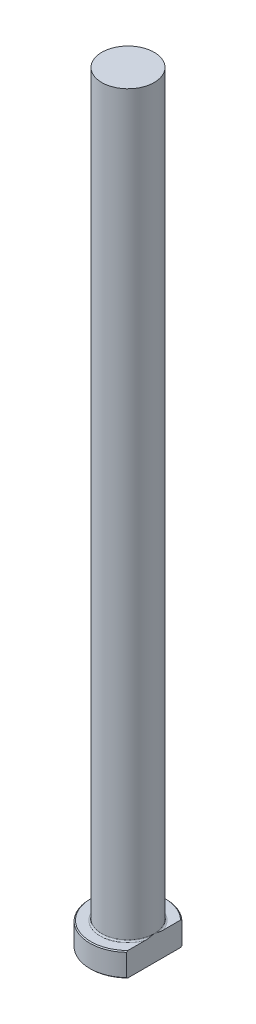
ISO-10303-21;
HEADER;
FILE_DESCRIPTION(('STEP AP214'),'2;1');
FILE_NAME('part.step','',(''),(''),'','','');
FILE_SCHEMA(('AUTOMOTIVE_DESIGN { 1 0 10303 214 1 1 1 1 }'));
ENDSEC;
DATA;
#1=APPLICATION_CONTEXT('core data for automotive mechanical design processes');
#2=APPLICATION_PROTOCOL_DEFINITION('international standard','automotive_design',2000,#1);
#3=PRODUCT_CONTEXT('',#1,'mechanical');
#4=PRODUCT('Part','Part','',(#3));
#5=PRODUCT_RELATED_PRODUCT_CATEGORY('part','',(#4));
#6=PRODUCT_DEFINITION_FORMATION('','',#4);
#7=PRODUCT_DEFINITION_CONTEXT('part definition',#1,'design');
#8=PRODUCT_DEFINITION('design','',#6,#7);
#9=PRODUCT_DEFINITION_SHAPE('','',#8);
#10=(LENGTH_UNIT() NAMED_UNIT(*) SI_UNIT(.MILLI.,.METRE.));
#11=(NAMED_UNIT(*) PLANE_ANGLE_UNIT() SI_UNIT($,.RADIAN.));
#12=(NAMED_UNIT(*) SI_UNIT($,.STERADIAN.) SOLID_ANGLE_UNIT());
#13=UNCERTAINTY_MEASURE_WITH_UNIT(LENGTH_MEASURE(1.E-05),#10,'distance_accuracy_value','');
#14=(GEOMETRIC_REPRESENTATION_CONTEXT(3) GLOBAL_UNCERTAINTY_ASSIGNED_CONTEXT((#13)) GLOBAL_UNIT_ASSIGNED_CONTEXT((#10,
#11,#12)) REPRESENTATION_CONTEXT('',''));
#15=CARTESIAN_POINT('',(0.,0.,0.));
#16=DIRECTION('',(0.,0.,1.));
#17=DIRECTION('',(1.,0.,0.));
#18=AXIS2_PLACEMENT_3D('',#15,#16,#17);
#19=CARTESIAN_POINT('',(0.,0.,0.));
#20=DIRECTION('',(0.,-1.,0.));
#21=DIRECTION('',(0.,0.,-1.));
#22=AXIS2_PLACEMENT_3D('',#19,#20,#21);
#23=PLANE('',#22);
#24=CARTESIAN_POINT('',(0.,0.,0.));
#25=DIRECTION('',(0.,-1.,0.));
#26=DIRECTION('',(0.,0.,-1.));
#27=AXIS2_PLACEMENT_3D('',#24,#25,#26);
#28=CIRCLE('',#27,7.79999999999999);
#29=CARTESIAN_POINT('',(5.49999999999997,0.,5.53082272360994));
#30=VERTEX_POINT('',#29);
#31=CARTESIAN_POINT('',(5.49999999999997,0.,-5.53082272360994));
#32=VERTEX_POINT('',#31);
#33=EDGE_CURVE('E98',#30,#32,#28,.T.);
#34=ORIENTED_EDGE('',*,*,#33,.T.);
#35=DIRECTION('',(0.,0.,1.));
#36=VECTOR('',#35,1.);
#37=CARTESIAN_POINT('',(5.49999999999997,0.,-5.80947501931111));
#38=LINE('',#37,#36);
#39=EDGE_CURVE('E83',#32,#30,#38,.T.);
#40=ORIENTED_EDGE('',*,*,#39,.T.);
#41=EDGE_LOOP('',(#34,#40));
#42=FACE_BOUND('',#41,.T.);
#43=ADVANCED_FACE('F32',(#42),#23,.T.);
#44=CARTESIAN_POINT('',(0.,259.958771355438,0.));
#45=DIRECTION('',(0.,1.,0.));
#46=DIRECTION('',(0.,0.,1.));
#47=AXIS2_PLACEMENT_3D('',#44,#45,#46);
#48=CYLINDRICAL_SURFACE('',#47,7.99999999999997);
#49=CARTESIAN_POINT('',(0.,4.79999999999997,0.));
#50=DIRECTION('',(0.,1.,0.));
#51=DIRECTION('',(0.,0.,1.));
#52=AXIS2_PLACEMENT_3D('',#49,#50,#51);
#53=CIRCLE('',#52,7.99999999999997);
#54=CARTESIAN_POINT('',(5.49999999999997,4.79999999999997,5.80947501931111));
#55=VERTEX_POINT('',#54);
#56=CARTESIAN_POINT('',(5.49999999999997,4.79999999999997,-5.80947501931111));
#57=VERTEX_POINT('',#56);
#58=EDGE_CURVE('E104',#55,#57,#53,.F.);
#59=ORIENTED_EDGE('',*,*,#58,.T.);
#60=DIRECTION('',(0.,-1.,0.));
#61=VECTOR('',#60,1.);
#62=CARTESIAN_POINT('',(5.49999999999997,160.,-5.80947501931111));
#63=LINE('',#62,#61);
#64=CARTESIAN_POINT('',(5.49999999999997,0.199999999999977,-5.80947501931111));
#65=VERTEX_POINT('',#64);
#66=EDGE_CURVE('E183',#57,#65,#63,.T.);
#67=ORIENTED_EDGE('',*,*,#66,.T.);
#68=CARTESIAN_POINT('',(0.,0.199999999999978,0.));
#69=DIRECTION('',(0.,-1.,0.));
#70=DIRECTION('',(0.,0.,-1.));
#71=AXIS2_PLACEMENT_3D('',#68,#69,#70);
#72=CIRCLE('',#71,7.99999999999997);
#73=CARTESIAN_POINT('',(5.49999999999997,0.199999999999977,5.80947501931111));
#74=VERTEX_POINT('',#73);
#75=EDGE_CURVE('E100',#65,#74,#72,.F.);
#76=ORIENTED_EDGE('',*,*,#75,.T.);
#77=DIRECTION('',(0.,-1.,0.));
#78=VECTOR('',#77,1.);
#79=CARTESIAN_POINT('',(5.49999999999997,160.,5.80947501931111));
#80=LINE('',#79,#78);
#81=EDGE_CURVE('E93',#55,#74,#80,.T.);
#82=ORIENTED_EDGE('',*,*,#81,.F.);
#83=EDGE_LOOP('',(#59,#67,#76,#82));
#84=FACE_BOUND('',#83,.T.);
#85=ADVANCED_FACE('F158',(#84),#48,.T.);
#86=CARTESIAN_POINT('',(-7.99999999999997,5.,0.));
#87=DIRECTION('',(0.,1.,0.));
#88=DIRECTION('',(0.,0.,1.));
#89=AXIS2_PLACEMENT_3D('',#86,#87,#88);
#90=PLANE('',#89);
#91=CARTESIAN_POINT('',(0.,5.,0.));
#92=DIRECTION('',(0.,1.,0.));
#93=DIRECTION('',(0.,0.,1.));
#94=AXIS2_PLACEMENT_3D('',#91,#92,#93);
#95=CIRCLE('',#94,7.79999999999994);
#96=CARTESIAN_POINT('',(5.49999999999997,5.,-5.53082272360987));
#97=VERTEX_POINT('',#96);
#98=CARTESIAN_POINT('',(5.49999999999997,5.,5.53082272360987));
#99=VERTEX_POINT('',#98);
#100=EDGE_CURVE('E178',#97,#99,#95,.T.);
#101=ORIENTED_EDGE('',*,*,#100,.T.);
#102=DIRECTION('',(0.,0.,-1.));
#103=VECTOR('',#102,1.);
#104=CARTESIAN_POINT('',(5.49999999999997,5.,0.));
#105=LINE('',#104,#103);
#106=CARTESIAN_POINT('',(5.49999999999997,4.99999999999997,1.84119526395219));
#107=VERTEX_POINT('',#106);
#108=EDGE_CURVE('E57',#99,#107,#105,.T.);
#109=ORIENTED_EDGE('',*,*,#108,.T.);
#110=CARTESIAN_POINT('',(0.,5.,0.));
#111=DIRECTION('',(0.,1.,0.));
#112=DIRECTION('',(0.,0.,1.));
#113=AXIS2_PLACEMENT_3D('',#110,#111,#112);
#114=CIRCLE('',#113,5.79999999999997);
#115=CARTESIAN_POINT('',(5.49999999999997,4.99999999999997,-1.84119526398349));
#116=VERTEX_POINT('',#115);
#117=EDGE_CURVE('E107',#107,#116,#114,.F.);
#118=ORIENTED_EDGE('',*,*,#117,.T.);
#119=EDGE_CURVE('E136',#116,#97,#105,.T.);
#120=ORIENTED_EDGE('',*,*,#119,.T.);
#121=EDGE_LOOP('',(#101,#109,#118,#120));
#122=FACE_BOUND('',#121,.T.);
#123=ADVANCED_FACE('F147',(#122),#90,.T.);
#124=CARTESIAN_POINT('',(0.,5.,0.));
#125=DIRECTION('',(0.,-1.,0.));
#126=DIRECTION('',(0.,0.,-1.));
#127=AXIS2_PLACEMENT_3D('',#124,#125,#126);
#128=CONICAL_SURFACE('',#127,7.79999999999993,0.785398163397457);
#129=ORIENTED_EDGE('',*,*,#58,.F.);
#130=CARTESIAN_POINT('',(5.49999999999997,-1.11515403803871,12.7820777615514));
#131=CARTESIAN_POINT('',(5.49999999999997,-0.941517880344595,12.5930460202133));
#132=CARTESIAN_POINT('',(5.49999999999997,-0.768204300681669,12.4037180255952));
#133=CARTESIAN_POINT('',(5.49999999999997,-0.422318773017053,12.0243831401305));
#134=CARTESIAN_POINT('',(5.49999999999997,-0.249746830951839,11.8343762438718));
#135=CARTESIAN_POINT('',(5.49999999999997,0.266785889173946,11.2631256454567));
#136=CARTESIAN_POINT('',(5.49999999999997,0.609484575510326,10.880737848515));
#137=CARTESIAN_POINT('',(5.49999999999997,1.292565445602,10.1095655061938));
#138=CARTESIAN_POINT('',(5.49999999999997,1.63291928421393,9.72075580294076));
#139=CARTESIAN_POINT('',(5.49999999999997,2.30738282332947,8.93782165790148));
#140=CARTESIAN_POINT('',(5.49999999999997,2.64149328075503,8.54369787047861));
#141=CARTESIAN_POINT('',(5.49999999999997,3.2425140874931,7.81851180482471));
#142=CARTESIAN_POINT('',(5.49999999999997,3.51085021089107,7.48863708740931));
#143=CARTESIAN_POINT('',(5.49999999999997,3.90712731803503,6.98880713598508));
#144=CARTESIAN_POINT('',(5.49999999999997,4.03820076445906,6.82133570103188));
#145=CARTESIAN_POINT('',(5.49999999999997,4.29784042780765,6.48446279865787));
#146=CARTESIAN_POINT('',(5.49999999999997,4.42640670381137,6.3150613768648));
#147=CARTESIAN_POINT('',(5.49999999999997,4.68038690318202,5.97419641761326));
#148=CARTESIAN_POINT('',(5.49999999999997,4.80580413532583,5.80273535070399));
#149=CARTESIAN_POINT('',(5.49999999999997,5.05297330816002,5.45719748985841));
#150=CARTESIAN_POINT('',(5.49999999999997,5.17472543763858,5.28312083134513));
#151=CARTESIAN_POINT('',(5.49999999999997,5.41367984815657,4.93196486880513));
#152=CARTESIAN_POINT('',(5.49999999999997,5.5308839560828,4.75488681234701));
#153=CARTESIAN_POINT('',(5.49999999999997,5.75968250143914,4.3971560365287));
#154=CARTESIAN_POINT('',(5.49999999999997,5.87127761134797,4.21650374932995));
#155=CARTESIAN_POINT('',(5.49999999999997,6.08629942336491,3.85292662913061));
#156=CARTESIAN_POINT('',(5.49999999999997,6.18979942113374,3.67004539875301));
#157=CARTESIAN_POINT('',(5.49999999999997,6.38808999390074,3.2995574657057));
#158=CARTESIAN_POINT('',(5.49999999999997,6.48287965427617,3.11195026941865));
#159=CARTESIAN_POINT('',(5.49999999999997,6.66127167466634,2.73169295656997));
#160=CARTESIAN_POINT('',(5.49999999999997,6.74488626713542,2.53904863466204));
#161=CARTESIAN_POINT('',(5.49999999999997,6.89808375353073,2.14822839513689));
#162=CARTESIAN_POINT('',(5.49999999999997,6.96767069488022,1.9500540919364));
#163=CARTESIAN_POINT('',(5.49999999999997,7.07670147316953,1.59030424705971));
#164=CARTESIAN_POINT('',(5.49999999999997,7.11940527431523,1.42972239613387));
#165=CARTESIAN_POINT('',(5.49999999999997,7.19217730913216,1.10570020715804));
#166=CARTESIAN_POINT('',(5.49999999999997,7.22224726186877,0.942260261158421));
#167=CARTESIAN_POINT('',(5.49999999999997,7.26823317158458,0.613832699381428));
#168=CARTESIAN_POINT('',(5.49999999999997,7.28418798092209,0.448850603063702));
#169=CARTESIAN_POINT('',(5.49999999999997,7.30121051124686,0.118111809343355));
#170=CARTESIAN_POINT('',(5.49999999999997,7.30227865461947,-0.0476448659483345));
#171=CARTESIAN_POINT('',(5.49999999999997,7.28946437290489,-0.378643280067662));
#172=CARTESIAN_POINT('',(5.49999999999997,7.27557532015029,-0.543884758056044));
#173=CARTESIAN_POINT('',(5.49999999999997,7.23360586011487,-0.872541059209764));
#174=CARTESIAN_POINT('',(5.49999999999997,7.20552424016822,-1.03595572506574));
#175=CARTESIAN_POINT('',(5.49999999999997,7.13645491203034,-1.36050703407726));
#176=CARTESIAN_POINT('',(5.49999999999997,7.09542895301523,-1.52163542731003));
#177=CARTESIAN_POINT('',(5.49999999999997,7.0022009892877,-1.84058362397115));
#178=CARTESIAN_POINT('',(5.49999999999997,6.949998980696,-1.99840342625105));
#179=CARTESIAN_POINT('',(5.49999999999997,6.82412729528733,-2.34351289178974));
#180=CARTESIAN_POINT('',(5.49999999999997,6.7482520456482,-2.52999311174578));
#181=CARTESIAN_POINT('',(5.49999999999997,6.58537605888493,-2.89807095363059));
#182=CARTESIAN_POINT('',(5.49999999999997,6.49837001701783,-3.07966619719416));
#183=CARTESIAN_POINT('',(5.49999999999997,6.31536700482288,-3.43865575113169));
#184=CARTESIAN_POINT('',(5.49999999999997,6.21935375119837,-3.61604169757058));
#185=CARTESIAN_POINT('',(5.49999999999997,6.02029718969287,-3.96676299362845));
#186=CARTESIAN_POINT('',(5.49999999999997,5.91725492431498,-4.14009893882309));
#187=CARTESIAN_POINT('',(5.49999999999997,5.70428964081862,-4.48528329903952));
#188=CARTESIAN_POINT('',(5.49999999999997,5.59430018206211,-4.65709053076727));
#189=CARTESIAN_POINT('',(5.49999999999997,5.36966321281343,-4.99762683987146));
#190=CARTESIAN_POINT('',(5.49999999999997,5.25501557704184,-5.16635583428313));
#191=CARTESIAN_POINT('',(5.49999999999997,5.02205528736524,-5.50098485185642));
#192=CARTESIAN_POINT('',(5.49999999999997,4.90374674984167,-5.66688774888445));
#193=CARTESIAN_POINT('',(5.49999999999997,4.66400808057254,-5.99642589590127));
#194=CARTESIAN_POINT('',(5.49999999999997,4.54257783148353,-6.16006106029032));
#195=CARTESIAN_POINT('',(5.49999999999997,4.20154795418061,-6.61207712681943));
#196=CARTESIAN_POINT('',(5.49999999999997,3.97915323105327,-6.89834873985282));
#197=CARTESIAN_POINT('',(5.49999999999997,3.52835863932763,-7.4661257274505));
#198=CARTESIAN_POINT('',(5.49999999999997,3.29995838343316,-7.74763079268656));
#199=CARTESIAN_POINT('',(5.49999999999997,2.83846100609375,-8.30706072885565));
#200=CARTESIAN_POINT('',(5.49999999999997,2.60536095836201,-8.58498318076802));
#201=CARTESIAN_POINT('',(5.49999999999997,2.13563301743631,-9.13783071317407));
#202=CARTESIAN_POINT('',(5.49999999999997,1.89900507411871,-9.41275575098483));
#203=CARTESIAN_POINT('',(5.49999999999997,1.43345389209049,-9.94811769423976));
#204=CARTESIAN_POINT('',(5.49999999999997,1.20465068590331,-10.2086591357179));
#205=CARTESIAN_POINT('',(5.49999999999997,0.744976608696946,-10.7279148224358));
#206=CARTESIAN_POINT('',(5.49999999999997,0.514105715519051,-10.9866290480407));
#207=CARTESIAN_POINT('',(5.49999999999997,0.0509694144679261,-11.502200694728));
#208=CARTESIAN_POINT('',(5.49999999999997,-0.181293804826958,-11.7590600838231));
#209=CARTESIAN_POINT('',(5.49999999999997,-0.647231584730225,-12.2714820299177));
#210=CARTESIAN_POINT('',(5.49999999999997,-0.880906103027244,-12.5270446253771));
#211=CARTESIAN_POINT('',(5.49999999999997,-1.11515403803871,-12.7820777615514));
#212=B_SPLINE_CURVE_WITH_KNOTS('',3,(#130,#131,#132,#133,#134,#135,#136,#137,#138,#139,#140,
#141,#142,#143,#144,#145,#146,#147,#148,#149,#150,#151,#152,#153,#154,#155,#156,#157,#158,#159,
#160,#161,#162,#163,#164,#165,#166,#167,#168,#169,#170,#171,#172,#173,#174,#175,#176,#177,#178,
#179,#180,#181,#182,#183,#184,#185,#186,#187,#188,#189,#190,#191,#192,#193,#194,#195,#196,#197,
#198,#199,#200,#201,#202,#203,#204,#205,#206,#207,#208,#209,#210,#211),.UNSPECIFIED.,.F.,.F.,(4,
2,2,2,2,2,2,2,2,2,2,2,2,2,2,2,2,2,2,2,2,2,2,2,2,2,2,2,2,2,2,2,2,2,2,2,2,2,2,2,4),(0.,
0.770026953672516,1.54006005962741,3.08047615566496,4.63063153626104,6.18059774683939,
7.45618053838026,8.09416066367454,8.73212573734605,9.36938977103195,10.0066209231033,
10.6435933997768,11.2804893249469,11.9107163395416,12.5410094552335,13.1706068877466,
13.8000224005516,14.2980757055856,14.7960612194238,15.2926717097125,15.7892681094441,
16.2860846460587,16.7829436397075,17.281284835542,17.7796262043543,18.383134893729,
18.9869322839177,19.5918430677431,20.1966643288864,20.8085675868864,21.4204873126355,
22.0317423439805,22.6430203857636,23.730416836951,24.8178835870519,25.9060497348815,
26.9942313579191,28.0344561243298,29.0746920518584,30.11358322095,31.1524433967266),.UNSPECIFIED.);
#213=EDGE_CURVE('E135',#55,#99,#212,.T.);
#214=ORIENTED_EDGE('',*,*,#213,.T.);
#215=ORIENTED_EDGE('',*,*,#100,.F.);
#216=EDGE_CURVE('E127',#97,#57,#212,.T.);
#217=ORIENTED_EDGE('',*,*,#216,.T.);
#218=EDGE_LOOP('',(#129,#214,#215,#217));
#219=FACE_BOUND('',#218,.T.);
#220=ADVANCED_FACE('F143',(#219),#128,.T.);
#221=CARTESIAN_POINT('',(0.,0.199999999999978,0.));
#222=DIRECTION('',(0.,1.,0.));
#223=DIRECTION('',(0.,0.,1.));
#224=AXIS2_PLACEMENT_3D('',#221,#222,#223);
#225=CONICAL_SURFACE('',#224,7.99999999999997,0.785398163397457);
#226=ORIENTED_EDGE('',*,*,#75,.F.);
#227=CARTESIAN_POINT('',(5.49999999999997,6.11515403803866,-12.7820777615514));
#228=CARTESIAN_POINT('',(5.49999999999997,5.94151788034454,-12.5930460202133));
#229=CARTESIAN_POINT('',(5.49999999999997,5.76820430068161,-12.4037180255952));
#230=CARTESIAN_POINT('',(5.49999999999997,5.422318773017,-12.0243831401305));
#231=CARTESIAN_POINT('',(5.49999999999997,5.24974683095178,-11.8343762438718));
#232=CARTESIAN_POINT('',(5.49999999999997,4.733214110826,-11.2631256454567));
#233=CARTESIAN_POINT('',(5.49999999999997,4.39051542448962,-10.880737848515));
#234=CARTESIAN_POINT('',(5.49999999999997,3.70743455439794,-10.1095655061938));
#235=CARTESIAN_POINT('',(5.49999999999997,3.36708071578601,-9.72075580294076));
#236=CARTESIAN_POINT('',(5.49999999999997,2.69261717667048,-8.93782165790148));
#237=CARTESIAN_POINT('',(5.49999999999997,2.35850671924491,-8.5436978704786));
#238=CARTESIAN_POINT('',(5.49999999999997,1.75748591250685,-7.81851180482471));
#239=CARTESIAN_POINT('',(5.49999999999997,1.48914978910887,-7.4886370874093));
#240=CARTESIAN_POINT('',(5.49999999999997,1.09287268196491,-6.98880713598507));
#241=CARTESIAN_POINT('',(5.49999999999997,0.96179923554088,-6.82133570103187));
#242=CARTESIAN_POINT('',(5.49999999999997,0.702159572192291,-6.48446279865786));
#243=CARTESIAN_POINT('',(5.49999999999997,0.573593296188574,-6.31506137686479));
#244=CARTESIAN_POINT('',(5.49999999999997,0.319613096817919,-5.97419641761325));
#245=CARTESIAN_POINT('',(5.49999999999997,0.194195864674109,-5.80273535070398));
#246=CARTESIAN_POINT('',(5.49999999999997,-0.0529733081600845,-5.4571974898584));
#247=CARTESIAN_POINT('',(5.49999999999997,-0.174725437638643,-5.28312083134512));
#248=CARTESIAN_POINT('',(5.49999999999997,-0.413679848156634,-4.93196486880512));
#249=CARTESIAN_POINT('',(5.49999999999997,-0.530883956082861,-4.75488681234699));
#250=CARTESIAN_POINT('',(5.49999999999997,-0.759682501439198,-4.39715603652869));
#251=CARTESIAN_POINT('',(5.49999999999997,-0.871277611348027,-4.21650374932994));
#252=CARTESIAN_POINT('',(5.49999999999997,-1.08629942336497,-3.8529266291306));
#253=CARTESIAN_POINT('',(5.49999999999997,-1.1897994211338,-3.67004539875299));
#254=CARTESIAN_POINT('',(5.49999999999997,-1.3880899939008,-3.29955746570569));
#255=CARTESIAN_POINT('',(5.49999999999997,-1.48287965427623,-3.11195026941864));
#256=CARTESIAN_POINT('',(5.49999999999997,-1.66127167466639,-2.73169295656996));
#257=CARTESIAN_POINT('',(5.49999999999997,-1.74488626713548,-2.53904863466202));
#258=CARTESIAN_POINT('',(5.49999999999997,-1.89808375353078,-2.14822839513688));
#259=CARTESIAN_POINT('',(5.49999999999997,-1.96767069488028,-1.95005409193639));
#260=CARTESIAN_POINT('',(5.49999999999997,-2.07670147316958,-1.5903042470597));
#261=CARTESIAN_POINT('',(5.49999999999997,-2.11940527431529,-1.42972239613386));
#262=CARTESIAN_POINT('',(5.49999999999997,-2.19217730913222,-1.10570020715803));
#263=CARTESIAN_POINT('',(5.49999999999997,-2.22224726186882,-0.942260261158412));
#264=CARTESIAN_POINT('',(5.49999999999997,-2.26823317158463,-0.613832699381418));
#265=CARTESIAN_POINT('',(5.49999999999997,-2.28418798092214,-0.448850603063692));
#266=CARTESIAN_POINT('',(5.49999999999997,-2.30121051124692,-0.118111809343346));
#267=CARTESIAN_POINT('',(5.49999999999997,-2.30227865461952,0.0476448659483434));
#268=CARTESIAN_POINT('',(5.49999999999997,-2.28946437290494,0.378643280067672));
#269=CARTESIAN_POINT('',(5.49999999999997,-2.27557532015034,0.543884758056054));
#270=CARTESIAN_POINT('',(5.49999999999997,-2.23360586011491,0.872541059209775));
#271=CARTESIAN_POINT('',(5.49999999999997,-2.20552424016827,1.03595572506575));
#272=CARTESIAN_POINT('',(5.49999999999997,-2.13645491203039,1.36050703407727));
#273=CARTESIAN_POINT('',(5.49999999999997,-2.09542895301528,1.52163542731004));
#274=CARTESIAN_POINT('',(5.49999999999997,-2.00220098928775,1.84058362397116));
#275=CARTESIAN_POINT('',(5.49999999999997,-1.94999898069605,1.99840342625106));
#276=CARTESIAN_POINT('',(5.49999999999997,-1.82412729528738,2.34351289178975));
#277=CARTESIAN_POINT('',(5.49999999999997,-1.74825204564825,2.52999311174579));
#278=CARTESIAN_POINT('',(5.49999999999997,-1.58537605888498,2.8980709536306));
#279=CARTESIAN_POINT('',(5.49999999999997,-1.49837001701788,3.07966619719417));
#280=CARTESIAN_POINT('',(5.49999999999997,-1.31536700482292,3.4386557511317));
#281=CARTESIAN_POINT('',(5.49999999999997,-1.21935375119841,3.6160416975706));
#282=CARTESIAN_POINT('',(5.49999999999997,-1.02029718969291,3.96676299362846));
#283=CARTESIAN_POINT('',(5.49999999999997,-0.917254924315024,4.1400989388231));
#284=CARTESIAN_POINT('',(5.49999999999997,-0.704289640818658,4.48528329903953));
#285=CARTESIAN_POINT('',(5.49999999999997,-0.594300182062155,4.65709053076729));
#286=CARTESIAN_POINT('',(5.49999999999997,-0.369663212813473,4.99762683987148));
#287=CARTESIAN_POINT('',(5.49999999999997,-0.255015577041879,5.16635583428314));
#288=CARTESIAN_POINT('',(5.49999999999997,-0.0220552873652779,5.50098485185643));
#289=CARTESIAN_POINT('',(5.49999999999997,0.0962532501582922,5.66688774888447));
#290=CARTESIAN_POINT('',(5.49999999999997,0.335991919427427,5.99642589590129));
#291=CARTESIAN_POINT('',(5.49999999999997,0.457422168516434,6.16006106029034));
#292=CARTESIAN_POINT('',(5.49999999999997,0.798452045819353,6.61207712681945));
#293=CARTESIAN_POINT('',(5.49999999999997,1.02084676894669,6.89834873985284));
#294=CARTESIAN_POINT('',(5.49999999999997,1.47164136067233,7.46612572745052));
#295=CARTESIAN_POINT('',(5.49999999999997,1.7000416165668,7.74763079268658));
#296=CARTESIAN_POINT('',(5.49999999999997,2.16153899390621,8.30706072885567));
#297=CARTESIAN_POINT('',(5.49999999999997,2.39463904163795,8.58498318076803));
#298=CARTESIAN_POINT('',(5.49999999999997,2.86436698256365,9.13783071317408));
#299=CARTESIAN_POINT('',(5.49999999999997,3.10099492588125,9.41275575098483));
#300=CARTESIAN_POINT('',(5.49999999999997,3.56654610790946,9.94811769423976));
#301=CARTESIAN_POINT('',(5.49999999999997,3.79534931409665,10.2086591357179));
#302=CARTESIAN_POINT('',(5.49999999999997,4.25502339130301,10.7279148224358));
#303=CARTESIAN_POINT('',(5.49999999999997,4.4858942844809,10.9866290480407));
#304=CARTESIAN_POINT('',(5.49999999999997,4.94903058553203,11.502200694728));
#305=CARTESIAN_POINT('',(5.49999999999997,5.18129380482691,11.7590600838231));
#306=CARTESIAN_POINT('',(5.49999999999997,5.64723158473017,12.2714820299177));
#307=CARTESIAN_POINT('',(5.49999999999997,5.88090610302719,12.5270446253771));
#308=CARTESIAN_POINT('',(5.49999999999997,6.11515403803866,12.7820777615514));
#309=B_SPLINE_CURVE_WITH_KNOTS('',3,(#227,#228,#229,#230,#231,#232,#233,#234,#235,#236,#237,
#238,#239,#240,#241,#242,#243,#244,#245,#246,#247,#248,#249,#250,#251,#252,#253,#254,#255,#256,
#257,#258,#259,#260,#261,#262,#263,#264,#265,#266,#267,#268,#269,#270,#271,#272,#273,#274,#275,
#276,#277,#278,#279,#280,#281,#282,#283,#284,#285,#286,#287,#288,#289,#290,#291,#292,#293,#294,
#295,#296,#297,#298,#299,#300,#301,#302,#303,#304,#305,#306,#307,#308),.UNSPECIFIED.,.F.,.F.,(4,
2,2,2,2,2,2,2,2,2,2,2,2,2,2,2,2,2,2,2,2,2,2,2,2,2,2,2,2,2,2,2,2,2,2,2,2,2,2,2,4),(0.,
0.770026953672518,1.54006005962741,3.08047615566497,4.63063153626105,6.18059774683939,
7.45618053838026,8.09416066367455,8.73212573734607,9.36938977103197,10.0066209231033,
10.6435933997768,11.280489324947,11.9107163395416,12.5410094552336,13.1706068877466,
13.8000224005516,14.2980757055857,14.7960612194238,15.2926717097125,15.7892681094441,
16.2860846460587,16.7829436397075,17.281284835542,17.7796262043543,18.383134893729,
18.9869322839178,19.5918430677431,20.1966643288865,20.8085675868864,21.4204873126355,
22.0317423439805,22.6430203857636,23.730416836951,24.8178835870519,25.9060497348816,
26.9942313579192,28.0344561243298,29.0746920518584,30.11358322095,31.1524433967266),.UNSPECIFIED.);
#310=EDGE_CURVE('E86',#65,#32,#309,.T.);
#311=ORIENTED_EDGE('',*,*,#310,.T.);
#312=ORIENTED_EDGE('',*,*,#33,.F.);
#313=EDGE_CURVE('E89',#30,#74,#309,.T.);
#314=ORIENTED_EDGE('',*,*,#313,.T.);
#315=EDGE_LOOP('',(#226,#311,#312,#314));
#316=FACE_BOUND('',#315,.T.);
#317=ADVANCED_FACE('F97',(#316),#225,.T.);
#318=CARTESIAN_POINT('',(0.,5.29999999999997,0.));
#319=DIRECTION('',(0.,1.,0.));
#320=DIRECTION('',(0.,0.,1.));
#321=AXIS2_PLACEMENT_3D('',#318,#319,#320);
#322=TOROIDAL_SURFACE('',#321,5.79999999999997,0.3);
#323=CARTESIAN_POINT('',(5.49999999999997,5.29999999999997,0.));
#324=CARTESIAN_POINT('',(5.49999999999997,5.30000062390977,1.37321730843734E-10));
#325=CARTESIAN_POINT('',(5.49999999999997,5.30000124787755,-2.69376376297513E-07));
#326=CARTESIAN_POINT('',(5.49999999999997,5.30000240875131,-9.99151691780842E-07));
#327=CARTESIAN_POINT('',(5.49999999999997,5.30000292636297,-1.47834826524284E-06));
#328=CARTESIAN_POINT('',(5.49999999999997,5.30000401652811,-2.63038637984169E-06));
#329=CARTESIAN_POINT('',(5.49999999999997,5.3000045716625,-3.32194614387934E-06));
#330=CARTESIAN_POINT('',(5.49999999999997,5.30000555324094,-4.74435536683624E-06));
#331=CARTESIAN_POINT('',(5.49999999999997,5.30000598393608,-5.47253605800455E-06));
#332=CARTESIAN_POINT('',(5.49999999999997,5.30000761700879,-8.33560288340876E-06));
#333=CARTESIAN_POINT('',(5.49999999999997,5.30000873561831,-1.05221151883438E-05));
#334=CARTESIAN_POINT('',(5.49999999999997,5.30001054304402,-1.48184286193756E-05));
#335=CARTESIAN_POINT('',(5.49999999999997,5.30001126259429,-1.69157853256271E-05));
#336=CARTESIAN_POINT('',(5.49999999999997,5.30001433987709,-2.59119235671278E-05));
#337=CARTESIAN_POINT('',(5.49999999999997,5.30001667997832,-3.28197570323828E-05));
#338=CARTESIAN_POINT('',(5.49999999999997,5.30002006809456,-4.57841698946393E-05));
#339=CARTESIAN_POINT('',(5.49999999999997,5.30002126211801,-5.18021293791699E-05));
#340=CARTESIAN_POINT('',(5.49999999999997,5.30003004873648,-9.68722229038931E-05));
#341=CARTESIAN_POINT('',(5.49999999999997,5.30003680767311,-0.000136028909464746));
#342=CARTESIAN_POINT('',(5.49999999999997,5.30006639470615,-0.000291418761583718));
#343=CARTESIAN_POINT('',(5.49999999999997,5.30009452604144,-0.000406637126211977));
#344=CARTESIAN_POINT('',(5.49999999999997,5.30020462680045,-0.000864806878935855));
#345=CARTESIAN_POINT('',(5.49999999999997,5.30028324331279,-0.00120829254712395));
#346=CARTESIAN_POINT('',(5.49999999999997,5.3005992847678,-0.00257937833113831));
#347=CARTESIAN_POINT('',(5.49999999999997,5.300840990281,-0.00360627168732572));
#348=CARTESIAN_POINT('',(5.49999999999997,5.30184970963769,-0.00790277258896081));
#349=CARTESIAN_POINT('',(5.49999999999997,5.30261131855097,-0.0111732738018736));
#350=CARTESIAN_POINT('',(5.49999999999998,5.30969442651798,-0.0415753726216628));
#351=CARTESIAN_POINT('',(5.49999999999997,5.31603915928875,-0.0687032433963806));
#352=CARTESIAN_POINT('',(5.49999999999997,5.32843561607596,-0.121865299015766));
#353=CARTESIAN_POINT('',(5.49999999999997,5.33448878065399,-0.147899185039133));
#354=CARTESIAN_POINT('',(5.49999999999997,5.34733836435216,-0.203330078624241));
#355=CARTESIAN_POINT('',(5.49999999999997,5.35413005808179,-0.232728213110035));
#356=CARTESIAN_POINT('',(5.49999999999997,5.36771480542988,-0.29186839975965));
#357=CARTESIAN_POINT('',(5.49999999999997,5.37450703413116,-0.321610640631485));
#358=CARTESIAN_POINT('',(5.49999999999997,5.3907398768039,-0.393246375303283));
#359=CARTESIAN_POINT('',(5.49999999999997,5.40013144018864,-0.435151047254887));
#360=CARTESIAN_POINT('',(5.49999999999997,5.41839331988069,-0.517899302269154));
#361=CARTESIAN_POINT('',(5.49999999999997,5.42727085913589,-0.558741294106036));
#362=CARTESIAN_POINT('',(5.49999999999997,5.45304047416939,-0.679649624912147));
#363=CARTESIAN_POINT('',(5.49999999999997,5.46946475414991,-0.759817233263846));
#364=CARTESIAN_POINT('',(5.49999999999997,5.50059525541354,-0.921248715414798));
#365=CARTESIAN_POINT('',(5.49999999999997,5.5152844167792,-1.00251591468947));
#366=CARTESIAN_POINT('',(5.49999999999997,5.54326935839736,-1.17291320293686));
#367=CARTESIAN_POINT('',(5.49999999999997,5.55631639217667,-1.2620853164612));
#368=CARTESIAN_POINT('',(5.49999999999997,5.57807460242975,-1.4407267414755));
#369=CARTESIAN_POINT('',(5.49999999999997,5.5867974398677,-1.53019459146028));
#370=CARTESIAN_POINT('',(5.49999999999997,5.59813646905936,-1.70678130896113));
#371=CARTESIAN_POINT('',(5.49999999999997,5.60093453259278,-1.79388646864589));
#372=CARTESIAN_POINT('',(5.49999999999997,5.59913730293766,-1.92371114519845));
#373=CARTESIAN_POINT('',(5.49999999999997,5.59757869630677,-1.96647130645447));
#374=CARTESIAN_POINT('',(5.49999999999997,5.59207086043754,-2.0518267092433));
#375=CARTESIAN_POINT('',(5.49999999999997,5.58812304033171,-2.09442203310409));
#376=CARTESIAN_POINT('',(5.49999999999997,5.57845042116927,-2.16952357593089));
#377=CARTESIAN_POINT('',(5.49999999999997,5.57333912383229,-2.20210765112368));
#378=CARTESIAN_POINT('',(5.49999999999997,5.56085936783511,-2.26696451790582));
#379=CARTESIAN_POINT('',(5.49999999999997,5.55348387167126,-2.29923601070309));
#380=CARTESIAN_POINT('',(5.49999999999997,5.53578949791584,-2.36314331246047));
#381=CARTESIAN_POINT('',(5.49999999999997,5.52545654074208,-2.39477528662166));
#382=CARTESIAN_POINT('',(5.49999999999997,5.50076223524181,-2.45658585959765));
#383=CARTESIAN_POINT('',(5.49999999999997,5.48639841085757,-2.48676355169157));
#384=CARTESIAN_POINT('',(5.49999999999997,5.45845930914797,-2.53258359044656));
#385=CARTESIAN_POINT('',(5.49999999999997,5.4467285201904,-2.54933279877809));
#386=CARTESIAN_POINT('',(5.49999999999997,5.42036237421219,-2.58032609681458));
#387=CARTESIAN_POINT('',(5.49999999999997,5.40575448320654,-2.59459164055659));
#388=CARTESIAN_POINT('',(5.49999999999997,5.38269146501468,-2.61139952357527));
#389=CARTESIAN_POINT('',(5.49999999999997,5.37567288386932,-2.6159011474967));
#390=CARTESIAN_POINT('',(5.49999999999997,5.36105421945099,-2.62385691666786));
#391=CARTESIAN_POINT('',(5.49999999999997,5.35345422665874,-2.62731122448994));
#392=CARTESIAN_POINT('',(5.49999999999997,5.33769516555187,-2.63292915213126));
#393=CARTESIAN_POINT('',(5.49999999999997,5.32953131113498,-2.63507966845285));
#394=CARTESIAN_POINT('',(5.49999999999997,5.31294528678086,-2.63780090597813));
#395=CARTESIAN_POINT('',(5.49999999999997,5.3045234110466,-2.63837336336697));
#396=CARTESIAN_POINT('',(5.49999999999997,5.28851094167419,-2.63789663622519));
#397=CARTESIAN_POINT('',(5.49999999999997,5.2809155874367,-2.63699270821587));
#398=CARTESIAN_POINT('',(5.49999999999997,5.26598512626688,-2.63392394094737));
#399=CARTESIAN_POINT('',(5.49999999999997,5.25865020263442,-2.6317582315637));
#400=CARTESIAN_POINT('',(5.49999999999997,5.24234078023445,-2.62556604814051));
#401=CARTESIAN_POINT('',(5.49999999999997,5.23350275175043,-2.62118324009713));
#402=CARTESIAN_POINT('',(5.49999999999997,5.21664244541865,-2.61106244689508));
#403=CARTESIAN_POINT('',(5.49999999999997,5.20862200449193,-2.60532150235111));
#404=CARTESIAN_POINT('',(5.49999999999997,5.18881724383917,-2.58912168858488));
#405=CARTESIAN_POINT('',(5.49999999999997,5.17766341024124,-2.57789934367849));
#406=CARTESIAN_POINT('',(5.49999999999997,5.15712865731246,-2.55396421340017));
#407=CARTESIAN_POINT('',(5.49999999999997,5.14775124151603,-2.54124856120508));
#408=CARTESIAN_POINT('',(5.49999999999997,5.1219531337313,-2.50201772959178));
#409=CARTESIAN_POINT('',(5.49999999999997,5.10760202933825,-2.47415772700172));
#410=CARTESIAN_POINT('',(5.49999999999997,5.08264412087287,-2.4167036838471));
#411=CARTESIAN_POINT('',(5.49999999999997,5.07206513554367,-2.38709856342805));
#412=CARTESIAN_POINT('',(5.49999999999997,5.04919805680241,-2.31224104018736));
#413=CARTESIAN_POINT('',(5.49999999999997,5.0386368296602,-2.26646729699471));
#414=CARTESIAN_POINT('',(5.49999999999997,5.02182095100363,-2.17406875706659));
#415=CARTESIAN_POINT('',(5.49999999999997,5.01557941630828,-2.12744180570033));
#416=CARTESIAN_POINT('',(5.49999999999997,5.00649716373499,-2.0351579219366));
#417=CARTESIAN_POINT('',(5.49999999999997,5.00356804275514,-1.98950936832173));
#418=CARTESIAN_POINT('',(5.49999999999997,5.00016782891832,-1.8983460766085));
#419=CARTESIAN_POINT('',(5.49999999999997,4.99968533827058,-1.85283170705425));
#420=CARTESIAN_POINT('',(5.49999999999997,5.00090888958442,-1.74240379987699));
#421=CARTESIAN_POINT('',(5.49999999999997,5.00363706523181,-1.67750284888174));
#422=CARTESIAN_POINT('',(5.49999999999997,5.01218141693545,-1.54793822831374));
#423=CARTESIAN_POINT('',(5.49999999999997,5.01799679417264,-1.48327450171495));
#424=CARTESIAN_POINT('',(5.49999999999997,5.03222723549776,-1.35268561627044));
#425=CARTESIAN_POINT('',(5.49999999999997,5.0407007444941,-1.28676695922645));
#426=CARTESIAN_POINT('',(5.49999999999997,5.05968062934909,-1.1550540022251));
#427=CARTESIAN_POINT('',(5.49999999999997,5.07019222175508,-1.08926046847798));
#428=CARTESIAN_POINT('',(5.49999999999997,5.09695256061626,-0.933785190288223));
#429=CARTESIAN_POINT('',(5.49999999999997,5.11388903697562,-0.844222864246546));
#430=CARTESIAN_POINT('',(5.49999999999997,5.14958548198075,-0.666532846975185));
#431=CARTESIAN_POINT('',(5.49999999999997,5.1683224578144,-0.578400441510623));
#432=CARTESIAN_POINT('',(5.49999999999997,5.20478806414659,-0.412629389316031));
#433=CARTESIAN_POINT('',(5.49999999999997,5.22238111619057,-0.334960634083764));
#434=CARTESIAN_POINT('',(5.49999999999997,5.24959866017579,-0.216510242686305));
#435=CARTESIAN_POINT('',(5.49999999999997,5.25904905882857,-0.175687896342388));
#436=CARTESIAN_POINT('',(5.49999999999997,5.27788780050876,-0.0947269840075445));
#437=CARTESIAN_POINT('',(5.49999999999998,5.28727465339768,-0.0545880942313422));
#438=CARTESIAN_POINT('',(5.49999999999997,5.29739035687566,-0.0111657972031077));
#439=CARTESIAN_POINT('',(5.49999999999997,5.29815375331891,-0.00788783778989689));
#440=CARTESIAN_POINT('',(5.49999999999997,5.29916288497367,-0.00358966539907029));
#441=CARTESIAN_POINT('',(5.49999999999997,5.29940322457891,-0.00256856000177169));
#442=CARTESIAN_POINT('',(5.49999999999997,5.2997176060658,-0.00120467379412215));
#443=CARTESIAN_POINT('',(5.49999999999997,5.29979589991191,-0.000862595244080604));
#444=CARTESIAN_POINT('',(5.49999999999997,5.29990561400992,-0.000406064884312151));
#445=CARTESIAN_POINT('',(5.49999999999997,5.2999336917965,-0.000291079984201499));
#446=CARTESIAN_POINT('',(5.49999999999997,5.29996322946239,-0.000135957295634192));
#447=CARTESIAN_POINT('',(5.49999999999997,5.29996998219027,-9.68324215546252E-05));
#448=CARTESIAN_POINT('',(5.49999999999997,5.29997875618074,-5.17949381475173E-05));
#449=CARTESIAN_POINT('',(5.49999999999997,5.29997994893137,-4.57786558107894E-05));
#450=CARTESIAN_POINT('',(5.49999999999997,5.29998333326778,-3.28177654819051E-05));
#451=CARTESIAN_POINT('',(5.49999999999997,5.2999856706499,-2.59116891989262E-05));
#452=CARTESIAN_POINT('',(5.49999999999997,5.29998874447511,-1.69173980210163E-05));
#453=CARTESIAN_POINT('',(5.49999999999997,5.29998946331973,-1.4820166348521E-05));
#454=CARTESIAN_POINT('',(5.49999999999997,5.29999126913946,-1.05239951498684E-05));
#455=CARTESIAN_POINT('',(5.49999999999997,5.29999238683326,-8.33748307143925E-06));
#456=CARTESIAN_POINT('',(5.49999999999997,5.29999401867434,-5.47429219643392E-06));
#457=CARTESIAN_POINT('',(5.49999999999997,5.29999444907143,-4.74604003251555E-06));
#458=CARTESIAN_POINT('',(5.49999999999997,5.29999543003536,-3.32343406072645E-06));
#459=CARTESIAN_POINT('',(5.49999999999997,5.29999598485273,-2.63174656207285E-06));
#460=CARTESIAN_POINT('',(5.49999999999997,5.29999707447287,-1.47941235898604E-06));
#461=CARTESIAN_POINT('',(5.49999999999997,5.29999759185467,-1.00005962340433E-06));
#462=CARTESIAN_POINT('',(5.49999999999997,5.29999875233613,-2.69883386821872E-07));
#463=CARTESIAN_POINT('',(5.49999999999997,5.29999937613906,-1.37310971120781E-10));
#464=CARTESIAN_POINT('',(5.49999999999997,5.29999999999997,0.));
#465=B_SPLINE_CURVE_WITH_KNOTS('',3,(#323,#324,#325,#326,#327,#328,#329,#330,#331,#332,#333,
#334,#335,#336,#337,#338,#339,#340,#341,#342,#343,#344,#345,#346,#347,#348,#349,#350,#351,#352,
#353,#354,#355,#356,#357,#358,#359,#360,#361,#362,#363,#364,#365,#366,#367,#368,#369,#370,#371,
#372,#373,#374,#375,#376,#377,#378,#379,#380,#381,#382,#383,#384,#385,#386,#387,#388,#389,#390,
#391,#392,#393,#394,#395,#396,#397,#398,#399,#400,#401,#402,#403,#404,#405,#406,#407,#408,#409,
#410,#411,#412,#413,#414,#415,#416,#417,#418,#419,#420,#421,#422,#423,#424,#425,#426,#427,#428,
#429,#430,#431,#432,#433,#434,#435,#436,#437,#438,#439,#440,#441,#442,#443,#444,#445,#446,#447,
#448,#449,#450,#451,#452,#453,#454,#455,#456,#457,#458,#459,#460,#461,#462,#463,#464),
.UNSPECIFIED.,.T.,.F.,(4,2,2,2,2,2,2,2,2,2,2,2,2,2,2,2,2,2,2,2,2,2,2,2,2,2,2,2,2,2,2,2,2,2,2,2,
2,2,2,2,2,2,2,2,2,2,2,2,2,2,2,2,2,2,2,2,2,2,2,2,2,2,2,2,2,2,2,2,2,2,4),(0.,1.89759089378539E-06,
4.0217832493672E-06,6.66436842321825E-06,9.20151056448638E-06,1.65449719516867E-05,
2.31908325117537E-05,4.50383514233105E-05,6.34229836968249E-05,0.000182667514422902,
0.000538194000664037,0.00159559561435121,0.00476009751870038,0.0148345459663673,
0.0984122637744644,0.178597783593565,0.269114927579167,0.360638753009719,0.489470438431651,
0.61485697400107,0.860339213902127,1.10806331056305,1.37834904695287,1.64790189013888,
1.90905265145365,2.03736998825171,2.16561171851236,2.26450233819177,2.36370349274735,
2.46338500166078,2.56312787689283,2.62428570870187,2.68488576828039,2.7098322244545,
2.73477480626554,2.75996408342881,2.78512563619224,2.80795720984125,2.8308045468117,
2.86023439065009,2.88972896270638,2.93692759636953,2.98421836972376,3.07771161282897,
3.17188074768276,3.31245630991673,3.45345688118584,3.59059834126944,3.7271003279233,
3.92187072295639,4.11659074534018,4.31593390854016,4.51579419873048,4.78920516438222,
5.05949875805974,5.29840417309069,5.42411083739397,5.54777320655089,5.55787065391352,
5.56101731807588,5.56207038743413,5.56242519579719,5.56254434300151,5.56256272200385,
5.56258456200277,5.56259120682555,5.56259854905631,5.56260108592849,5.56260372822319,
5.56260585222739,5.5626077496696),.UNSPECIFIED.);
#466=CARTESIAN_POINT('',(5.49999999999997,5.29999999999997,0.));
#467=VERTEX_POINT('',#466);
#468=EDGE_CURVE('E11',#116,#467,#465,.T.);
#469=ORIENTED_EDGE('',*,*,#468,.F.);
#470=ORIENTED_EDGE('',*,*,#117,.F.);
#471=CARTESIAN_POINT('',(5.49999999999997,5.29999999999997,0.));
#472=CARTESIAN_POINT('',(5.49999999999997,5.29999937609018,-1.37321567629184E-10));
#473=CARTESIAN_POINT('',(5.49999999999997,5.29999875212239,2.69376376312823E-07));
#474=CARTESIAN_POINT('',(5.49999999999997,5.29999759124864,9.9915169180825E-07));
#475=CARTESIAN_POINT('',(5.49999999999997,5.29999707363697,1.47834826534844E-06));
#476=CARTESIAN_POINT('',(5.49999999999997,5.29999598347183,2.6303863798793E-06));
#477=CARTESIAN_POINT('',(5.49999999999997,5.29999542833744,3.32194614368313E-06));
#478=CARTESIAN_POINT('',(5.49999999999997,5.299994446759,4.74435536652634E-06));
#479=CARTESIAN_POINT('',(5.49999999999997,5.29999401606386,5.47253605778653E-06));
#480=CARTESIAN_POINT('',(5.49999999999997,5.29999238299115,8.33560288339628E-06));
#481=CARTESIAN_POINT('',(5.49999999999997,5.29999126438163,1.05221151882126E-05));
#482=CARTESIAN_POINT('',(5.49999999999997,5.29998945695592,1.48184286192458E-05));
#483=CARTESIAN_POINT('',(5.49999999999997,5.29998873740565,1.69157853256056E-05));
#484=CARTESIAN_POINT('',(5.49999999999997,5.29998566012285,2.59119235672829E-05));
#485=CARTESIAN_POINT('',(5.49999999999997,5.29998332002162,3.28197570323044E-05));
#486=CARTESIAN_POINT('',(5.49999999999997,5.29997993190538,4.57841698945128E-05));
#487=CARTESIAN_POINT('',(5.49999999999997,5.29997873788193,5.18021293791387E-05));
#488=CARTESIAN_POINT('',(5.49999999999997,5.29996995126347,9.68722229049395E-05));
#489=CARTESIAN_POINT('',(5.49999999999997,5.29996319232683,0.000136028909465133));
#490=CARTESIAN_POINT('',(5.49999999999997,5.29993360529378,0.000291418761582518));
#491=CARTESIAN_POINT('',(5.49999999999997,5.2999054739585,0.000406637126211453));
#492=CARTESIAN_POINT('',(5.49999999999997,5.2997953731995,0.000864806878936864));
#493=CARTESIAN_POINT('',(5.49999999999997,5.29971675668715,0.00120829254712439));
#494=CARTESIAN_POINT('',(5.49999999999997,5.29940071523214,0.00257937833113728));
#495=CARTESIAN_POINT('',(5.49999999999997,5.29915900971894,0.00360627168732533));
#496=CARTESIAN_POINT('',(5.49999999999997,5.29815029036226,0.00790277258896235));
#497=CARTESIAN_POINT('',(5.49999999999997,5.29738868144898,0.0111732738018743));
#498=CARTESIAN_POINT('',(5.49999999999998,5.29030557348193,0.0415753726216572));
#499=CARTESIAN_POINT('',(5.49999999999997,5.28396084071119,0.0687032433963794));
#500=CARTESIAN_POINT('',(5.49999999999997,5.27156438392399,0.121865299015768));
#501=CARTESIAN_POINT('',(5.49999999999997,5.26551121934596,0.147899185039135));
#502=CARTESIAN_POINT('',(5.49999999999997,5.25266163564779,0.203330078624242));
#503=CARTESIAN_POINT('',(5.49999999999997,5.24586994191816,0.232728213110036));
#504=CARTESIAN_POINT('',(5.49999999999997,5.23228519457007,0.291868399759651));
#505=CARTESIAN_POINT('',(5.49999999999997,5.22549296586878,0.321610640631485));
#506=CARTESIAN_POINT('',(5.49999999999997,5.20926012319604,0.393246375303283));
#507=CARTESIAN_POINT('',(5.49999999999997,5.1998685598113,0.435151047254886));
#508=CARTESIAN_POINT('',(5.49999999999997,5.18160668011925,0.517899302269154));
#509=CARTESIAN_POINT('',(5.49999999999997,5.17272914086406,0.558741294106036));
#510=CARTESIAN_POINT('',(5.49999999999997,5.14695952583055,0.679649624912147));
#511=CARTESIAN_POINT('',(5.49999999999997,5.13053524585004,0.759817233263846));
#512=CARTESIAN_POINT('',(5.49999999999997,5.09940474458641,0.921248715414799));
#513=CARTESIAN_POINT('',(5.49999999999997,5.08471558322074,1.00251591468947));
#514=CARTESIAN_POINT('',(5.49999999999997,5.05673064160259,1.17291320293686));
#515=CARTESIAN_POINT('',(5.49999999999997,5.04368360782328,1.2620853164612));
#516=CARTESIAN_POINT('',(5.49999999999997,5.0219253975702,1.4407267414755));
#517=CARTESIAN_POINT('',(5.49999999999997,5.01320256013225,1.53019459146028));
#518=CARTESIAN_POINT('',(5.49999999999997,5.00186353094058,1.70678130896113));
#519=CARTESIAN_POINT('',(5.49999999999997,4.99906546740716,1.79388646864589));
#520=CARTESIAN_POINT('',(5.49999999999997,5.00086269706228,1.92371114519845));
#521=CARTESIAN_POINT('',(5.49999999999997,5.00242130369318,1.96647130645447));
#522=CARTESIAN_POINT('',(5.49999999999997,5.00792913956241,2.0518267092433));
#523=CARTESIAN_POINT('',(5.49999999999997,5.01187695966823,2.09442203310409));
#524=CARTESIAN_POINT('',(5.49999999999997,5.02154957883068,2.16952357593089));
#525=CARTESIAN_POINT('',(5.49999999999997,5.02666087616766,2.20210765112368));
#526=CARTESIAN_POINT('',(5.49999999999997,5.03914063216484,2.26696451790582));
#527=CARTESIAN_POINT('',(5.49999999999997,5.04651612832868,2.29923601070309));
#528=CARTESIAN_POINT('',(5.49999999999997,5.0642105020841,2.36314331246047));
#529=CARTESIAN_POINT('',(5.49999999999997,5.07454345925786,2.39477528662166));
#530=CARTESIAN_POINT('',(5.49999999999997,5.09923776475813,2.45658585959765));
#531=CARTESIAN_POINT('',(5.49999999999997,5.11360158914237,2.48676355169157));
#532=CARTESIAN_POINT('',(5.49999999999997,5.14154069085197,2.53258359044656));
#533=CARTESIAN_POINT('',(5.49999999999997,5.15327147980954,2.54933279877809));
#534=CARTESIAN_POINT('',(5.49999999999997,5.17963762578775,2.58032609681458));
#535=CARTESIAN_POINT('',(5.49999999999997,5.1942455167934,2.59459164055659));
#536=CARTESIAN_POINT('',(5.49999999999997,5.21730853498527,2.61139952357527));
#537=CARTESIAN_POINT('',(5.49999999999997,5.22432711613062,2.6159011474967));
#538=CARTESIAN_POINT('',(5.49999999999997,5.23894578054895,2.62385691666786));
#539=CARTESIAN_POINT('',(5.49999999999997,5.2465457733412,2.62731122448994));
#540=CARTESIAN_POINT('',(5.49999999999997,5.26230483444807,2.63292915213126));
#541=CARTESIAN_POINT('',(5.49999999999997,5.27046868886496,2.63507966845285));
#542=CARTESIAN_POINT('',(5.49999999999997,5.28705471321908,2.63780090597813));
#543=CARTESIAN_POINT('',(5.49999999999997,5.29547658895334,2.63837336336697));
#544=CARTESIAN_POINT('',(5.49999999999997,5.31148905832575,2.63789663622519));
#545=CARTESIAN_POINT('',(5.49999999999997,5.31908441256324,2.63699270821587));
#546=CARTESIAN_POINT('',(5.49999999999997,5.33401487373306,2.63392394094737));
#547=CARTESIAN_POINT('',(5.49999999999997,5.34134979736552,2.6317582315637));
#548=CARTESIAN_POINT('',(5.49999999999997,5.35765921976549,2.62556604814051));
#549=CARTESIAN_POINT('',(5.49999999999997,5.36649724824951,2.62118324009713));
#550=CARTESIAN_POINT('',(5.49999999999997,5.38335755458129,2.61106244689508));
#551=CARTESIAN_POINT('',(5.49999999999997,5.39137799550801,2.60532150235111));
#552=CARTESIAN_POINT('',(5.49999999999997,5.41118275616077,2.58912168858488));
#553=CARTESIAN_POINT('',(5.49999999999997,5.4223365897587,2.57789934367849));
#554=CARTESIAN_POINT('',(5.49999999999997,5.44287134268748,2.55396421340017));
#555=CARTESIAN_POINT('',(5.49999999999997,5.45224875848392,2.54124856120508));
#556=CARTESIAN_POINT('',(5.49999999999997,5.47804686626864,2.50201772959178));
#557=CARTESIAN_POINT('',(5.49999999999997,5.4923979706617,2.47415772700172));
#558=CARTESIAN_POINT('',(5.49999999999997,5.51735587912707,2.4167036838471));
#559=CARTESIAN_POINT('',(5.49999999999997,5.52793486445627,2.38709856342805));
#560=CARTESIAN_POINT('',(5.49999999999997,5.55080194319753,2.31224104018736));
#561=CARTESIAN_POINT('',(5.49999999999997,5.56136317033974,2.26646729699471));
#562=CARTESIAN_POINT('',(5.49999999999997,5.57817904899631,2.17406875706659));
#563=CARTESIAN_POINT('',(5.49999999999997,5.58442058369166,2.12744180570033));
#564=CARTESIAN_POINT('',(5.49999999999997,5.59350283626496,2.0351579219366));
#565=CARTESIAN_POINT('',(5.49999999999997,5.59643195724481,1.98950936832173));
#566=CARTESIAN_POINT('',(5.49999999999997,5.59983217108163,1.8983460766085));
#567=CARTESIAN_POINT('',(5.49999999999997,5.60031466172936,1.85283170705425));
#568=CARTESIAN_POINT('',(5.49999999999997,5.59909111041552,1.74240379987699));
#569=CARTESIAN_POINT('',(5.49999999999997,5.59636293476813,1.67750284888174));
#570=CARTESIAN_POINT('',(5.49999999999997,5.5878185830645,1.54793822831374));
#571=CARTESIAN_POINT('',(5.49999999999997,5.5820032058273,1.48327450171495));
#572=CARTESIAN_POINT('',(5.49999999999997,5.56777276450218,1.35268561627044));
#573=CARTESIAN_POINT('',(5.49999999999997,5.55929925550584,1.28676695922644));
#574=CARTESIAN_POINT('',(5.49999999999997,5.54031937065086,1.1550540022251));
#575=CARTESIAN_POINT('',(5.49999999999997,5.52980777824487,1.08926046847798));
#576=CARTESIAN_POINT('',(5.49999999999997,5.50304743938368,0.933785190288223));
#577=CARTESIAN_POINT('',(5.49999999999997,5.48611096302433,0.844222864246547));
#578=CARTESIAN_POINT('',(5.49999999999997,5.45041451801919,0.666532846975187));
#579=CARTESIAN_POINT('',(5.49999999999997,5.43167754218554,0.578400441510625));
#580=CARTESIAN_POINT('',(5.49999999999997,5.39521193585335,0.412629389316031));
#581=CARTESIAN_POINT('',(5.49999999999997,5.37761888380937,0.334960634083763));
#582=CARTESIAN_POINT('',(5.49999999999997,5.35040133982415,0.216510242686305));
#583=CARTESIAN_POINT('',(5.49999999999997,5.34095094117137,0.17568789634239));
#584=CARTESIAN_POINT('',(5.49999999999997,5.32211219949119,0.0947269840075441));
#585=CARTESIAN_POINT('',(5.49999999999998,5.31272534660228,0.0545880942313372));
#586=CARTESIAN_POINT('',(5.49999999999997,5.30260964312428,0.0111657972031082));
#587=CARTESIAN_POINT('',(5.49999999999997,5.30184624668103,0.00788783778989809));
#588=CARTESIAN_POINT('',(5.49999999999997,5.30083711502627,0.00358966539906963));
#589=CARTESIAN_POINT('',(5.49999999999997,5.30059677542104,0.00256856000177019));
#590=CARTESIAN_POINT('',(5.49999999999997,5.30028239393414,0.0012046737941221));
#591=CARTESIAN_POINT('',(5.49999999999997,5.30020410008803,0.000862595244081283));
#592=CARTESIAN_POINT('',(5.49999999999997,5.30009438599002,0.00040606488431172));
#593=CARTESIAN_POINT('',(5.49999999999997,5.30006630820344,0.00029107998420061));
#594=CARTESIAN_POINT('',(5.49999999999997,5.30003677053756,0.000135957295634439));
#595=CARTESIAN_POINT('',(5.49999999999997,5.30003001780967,9.68324215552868E-05));
#596=CARTESIAN_POINT('',(5.49999999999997,5.3000212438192,5.17949381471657E-05));
#597=CARTESIAN_POINT('',(5.49999999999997,5.30002005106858,4.57786558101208E-05));
#598=CARTESIAN_POINT('',(5.49999999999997,5.30001666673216,3.28177654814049E-05));
#599=CARTESIAN_POINT('',(5.49999999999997,5.30001432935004,2.59116891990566E-05));
#600=CARTESIAN_POINT('',(5.49999999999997,5.30001125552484,1.69173980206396E-05));
#601=CARTESIAN_POINT('',(5.49999999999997,5.30001053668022,1.48201663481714E-05));
#602=CARTESIAN_POINT('',(5.49999999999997,5.30000873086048,1.05239951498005E-05));
#603=CARTESIAN_POINT('',(5.49999999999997,5.30000761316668,8.33748307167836E-06));
#604=CARTESIAN_POINT('',(5.49999999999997,5.3000059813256,5.47429219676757E-06));
#605=CARTESIAN_POINT('',(5.49999999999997,5.30000555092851,4.74604003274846E-06));
#606=CARTESIAN_POINT('',(5.49999999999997,5.30000456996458,3.32343406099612E-06));
#607=CARTESIAN_POINT('',(5.49999999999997,5.30000401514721,2.63174656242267E-06));
#608=CARTESIAN_POINT('',(5.49999999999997,5.30000292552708,1.47941235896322E-06));
#609=CARTESIAN_POINT('',(5.49999999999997,5.30000240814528,1.00005962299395E-06));
#610=CARTESIAN_POINT('',(5.49999999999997,5.30000124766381,2.69883386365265E-07));
#611=CARTESIAN_POINT('',(5.49999999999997,5.30000062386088,1.37310807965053E-10));
#612=CARTESIAN_POINT('',(5.49999999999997,5.29999999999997,0.));
#613=B_SPLINE_CURVE_WITH_KNOTS('',3,(#471,#472,#473,#474,#475,#476,#477,#478,#479,#480,#481,
#482,#483,#484,#485,#486,#487,#488,#489,#490,#491,#492,#493,#494,#495,#496,#497,#498,#499,#500,
#501,#502,#503,#504,#505,#506,#507,#508,#509,#510,#511,#512,#513,#514,#515,#516,#517,#518,#519,
#520,#521,#522,#523,#524,#525,#526,#527,#528,#529,#530,#531,#532,#533,#534,#535,#536,#537,#538,
#539,#540,#541,#542,#543,#544,#545,#546,#547,#548,#549,#550,#551,#552,#553,#554,#555,#556,#557,
#558,#559,#560,#561,#562,#563,#564,#565,#566,#567,#568,#569,#570,#571,#572,#573,#574,#575,#576,
#577,#578,#579,#580,#581,#582,#583,#584,#585,#586,#587,#588,#589,#590,#591,#592,#593,#594,#595,
#596,#597,#598,#599,#600,#601,#602,#603,#604,#605,#606,#607,#608,#609,#610,#611,#612),
.UNSPECIFIED.,.T.,.F.,(4,2,2,2,2,2,2,2,2,2,2,2,2,2,2,2,2,2,2,2,2,2,2,2,2,2,2,2,2,2,2,2,2,2,2,2,
2,2,2,2,2,2,2,2,2,2,2,2,2,2,2,2,2,2,2,2,2,2,2,2,2,2,2,2,2,2,2,2,2,2,4),(0.,1.89759089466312E-06,
4.02178324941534E-06,6.66436842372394E-06,9.20151056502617E-06,1.65449719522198E-05,
2.31908325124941E-05,4.50383514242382E-05,6.3422983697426E-05,0.000182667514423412,
0.000538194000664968,0.00159559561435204,0.00476009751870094,0.0148345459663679,
0.0984122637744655,0.178597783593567,0.269114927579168,0.36063875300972,0.489470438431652,
0.61485697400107,0.860339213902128,1.10806331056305,1.37834904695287,1.64790189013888,
1.90905265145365,2.03736998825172,2.16561171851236,2.26450233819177,2.36370349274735,
2.46338500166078,2.56312787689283,2.62428570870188,2.68488576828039,2.7098322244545,
2.73477480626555,2.75996408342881,2.78512563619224,2.80795720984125,2.8308045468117,
2.86023439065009,2.88972896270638,2.93692759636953,2.98421836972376,3.07771161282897,
3.17188074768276,3.31245630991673,3.45345688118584,3.59059834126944,3.7271003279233,
3.92187072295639,4.11659074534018,4.31593390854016,4.51579419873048,4.78920516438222,
5.05949875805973,5.29840417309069,5.42411083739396,5.54777320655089,5.55787065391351,
5.56101731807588,5.56207038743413,5.56242519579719,5.56254434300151,5.56256272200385,
5.56258456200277,5.56259120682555,5.56259854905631,5.56260108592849,5.56260372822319,
5.56260585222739,5.5626077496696),.UNSPECIFIED.);
#614=EDGE_CURVE('E46',#467,#107,#613,.T.);
#615=ORIENTED_EDGE('',*,*,#614,.F.);
#616=CARTESIAN_POINT('',(0.,5.29999999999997,0.));
#617=DIRECTION('',(0.,1.,0.));
#618=DIRECTION('',(0.,0.,1.));
#619=AXIS2_PLACEMENT_3D('',#616,#617,#618);
#620=CIRCLE('',#619,5.49999999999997);
#621=EDGE_CURVE('E103',#467,#467,#620,.T.);
#622=ORIENTED_EDGE('',*,*,#621,.F.);
#623=EDGE_LOOP('',(#469,#470,#615,#622));
#624=FACE_BOUND('',#623,.T.);
#625=ADVANCED_FACE('F34',(#624),#322,.F.);
#626=CARTESIAN_POINT('',(0.,259.958771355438,0.));
#627=DIRECTION('',(0.,1.,0.));
#628=DIRECTION('',(0.,0.,1.));
#629=AXIS2_PLACEMENT_3D('',#626,#627,#628);
#630=CYLINDRICAL_SURFACE('',#629,5.49999999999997);
#631=ORIENTED_EDGE('',*,*,#621,.T.);
#632=EDGE_LOOP('',(#631));
#633=FACE_BOUND('',#632,.T.);
#634=CARTESIAN_POINT('',(0.,160.,0.));
#635=DIRECTION('',(0.,1.,0.));
#636=DIRECTION('',(0.,0.,1.));
#637=AXIS2_PLACEMENT_3D('',#634,#635,#636);
#638=CIRCLE('',#637,5.49999999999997);
#639=CARTESIAN_POINT('',(0.,160.,5.49999999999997));
#640=VERTEX_POINT('',#639);
#641=EDGE_CURVE('E101',#640,#640,#638,.T.);
#642=ORIENTED_EDGE('',*,*,#641,.F.);
#643=EDGE_LOOP('',(#642));
#644=FACE_BOUND('',#643,.T.);
#645=ADVANCED_FACE('F155',(#633,#644),#630,.T.);
#646=CARTESIAN_POINT('',(-5.49999999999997,160.,0.));
#647=DIRECTION('',(0.,1.,0.));
#648=DIRECTION('',(0.,0.,1.));
#649=AXIS2_PLACEMENT_3D('',#646,#647,#648);
#650=PLANE('',#649);
#651=ORIENTED_EDGE('',*,*,#641,.T.);
#652=EDGE_LOOP('',(#651));
#653=FACE_BOUND('',#652,.T.);
#654=ADVANCED_FACE('F121',(#653),#650,.T.);
#655=CARTESIAN_POINT('',(5.49999999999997,160.,-5.80947501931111));
#656=DIRECTION('',(1.,0.,0.));
#657=DIRECTION('',(0.,0.,-1.));
#658=AXIS2_PLACEMENT_3D('',#655,#656,#657);
#659=PLANE('',#658);
#660=ORIENTED_EDGE('',*,*,#66,.F.);
#661=ORIENTED_EDGE('',*,*,#216,.F.);
#662=ORIENTED_EDGE('',*,*,#119,.F.);
#663=ORIENTED_EDGE('',*,*,#468,.T.);
#664=ORIENTED_EDGE('',*,*,#614,.T.);
#665=ORIENTED_EDGE('',*,*,#108,.F.);
#666=ORIENTED_EDGE('',*,*,#213,.F.);
#667=ORIENTED_EDGE('',*,*,#81,.T.);
#668=ORIENTED_EDGE('',*,*,#313,.F.);
#669=ORIENTED_EDGE('',*,*,#39,.F.);
#670=ORIENTED_EDGE('',*,*,#310,.F.);
#671=EDGE_LOOP('',(#660,#661,#662,#663,#664,#665,#666,#667,#668,#669,#670));
#672=FACE_BOUND('',#671,.T.);
#673=ADVANCED_FACE('F85',(#672),#659,.T.);
#674=CLOSED_SHELL('',(#43,#85,#123,#220,#317,#625,#645,#654,#673));
#675=MANIFOLD_SOLID_BREP('B2',#674);
#676=ADVANCED_BREP_SHAPE_REPRESENTATION('',(#18,#675),#14);
#677=SHAPE_DEFINITION_REPRESENTATION(#9,#676);
ENDSEC;
END-ISO-10303-21;
